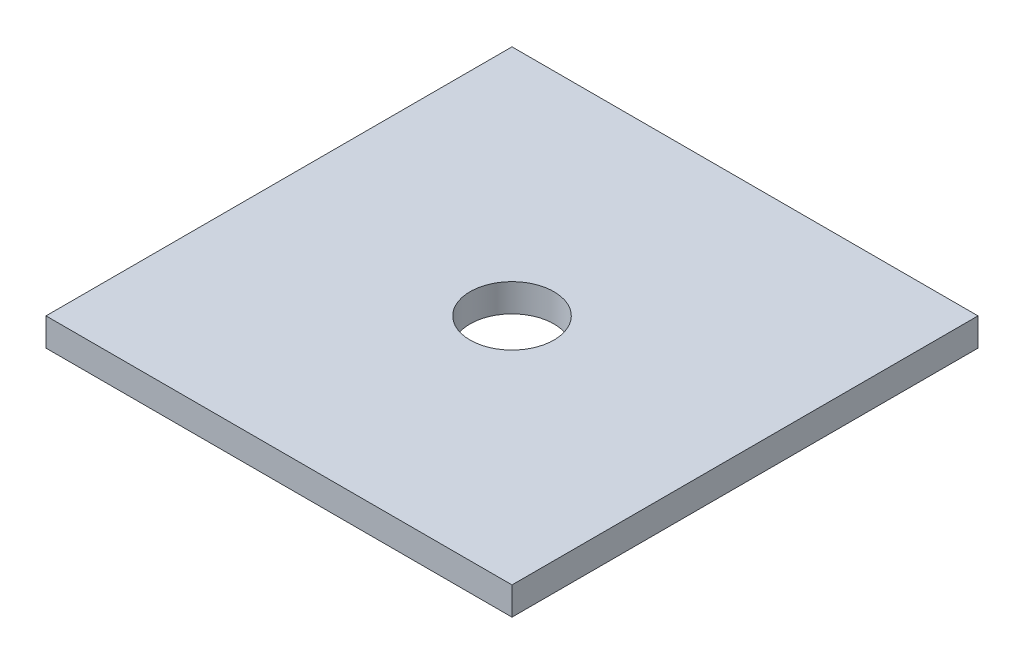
from build123d import *

# Parameters (mm, degrees)
SKETCH1_W      = 50
SKETCH1_H      = 50
SKETCH1_R      = 4.5
EXTRUDE1_DEPTH = 3


with BuildPart() as part:
    # Sketch1 → Extrude1 (new body)
    with BuildSketch(Plane(origin=(0, 0, 0), x_dir=(1, 0, 0), z_dir=(0, 1, 0))):
        with Locations((25, 25)):
            Rectangle(SKETCH1_W, SKETCH1_H)
        with Locations(Location((25, 25, 0), (0, 0, 270))):
            Circle(SKETCH1_R, mode=Mode.SUBTRACT)
    extrude(amount=EXTRUDE1_DEPTH)


solid = part.part
